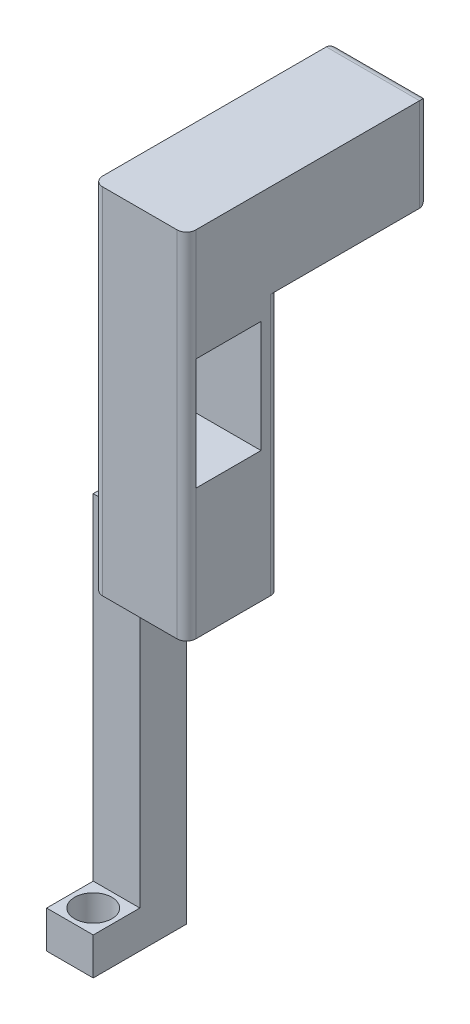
from build123d import *

# Parameters (mm, degrees)
SKETCH1_W           = 7.5
SKETCH1_H           = 5
BOSS_EXTRUDE1_DEPTH = 2
SKETCH2_W           = 5
SKETCH2_H           = 5
BOSS_EXTRUDE5_DEPTH = 17
SKETCH8_W           = 5
SKETCH8_H           = 5
BOSS_EXTRUDE6_DEPTH = 8
SKETCH9_W           = 2.5
SKETCH9_H           = 5
BOSS_EXTRUDE7_DEPTH = 18
SKETCH10_W          = 2.5
SKETCH10_H          = 18
CUT_EXTRUDE4_DEPTH  = 2.5
CUT_EXTRUDE5_DEPTH  = 2.5
FILLET2_R           = 0.5
SKETCH12_W          = 3.5
SKETCH12_H          = 6
CUT_EXTRUDE6_DEPTH  = 5


with BuildPart() as part:
    # Sketch1 → Boss-Extrude1 (new body)
    with BuildSketch(Plane(origin=(0, 0, 0), x_dir=(1, 0, 0), z_dir=(0, 1, 0))):
        Rectangle(SKETCH1_W, SKETCH1_H)
    extrude(amount=BOSS_EXTRUDE1_DEPTH)

    # Sketch2 → Boss-Extrude5 (add)
    with BuildSketch(Plane(origin=(0, 2, 0), x_dir=(1, 0, 0), z_dir=(0, 1, 0))):
        with Locations((1.25, 0)):
            Rectangle(SKETCH2_W, SKETCH2_H)
    extrude(amount=BOSS_EXTRUDE5_DEPTH)

    # Sketch8 → Boss-Extrude6 (add)
    with BuildSketch(Plane(origin=(0, 0, -2.5), x_dir=(-1, 0, 0), z_dir=(0, 0, -1))):
        with Locations((-1.25, 16.5)):
            Rectangle(SKETCH8_W, SKETCH8_H)
    extrude(amount=BOSS_EXTRUDE6_DEPTH)

    # Sketch9 → Boss-Extrude7 (add)
    with BuildSketch(Plane.XZ):
        with Locations((-2.5, 0)):
            Rectangle(SKETCH9_W, SKETCH9_H)
    extrude(amount=BOSS_EXTRUDE7_DEPTH)

    # Sketch10 → Cut-Extrude4 (cut)
    with BuildSketch(Plane.ZY.offset(3.75)):
        with Locations((1.25, -7)):
            Rectangle(SKETCH10_W, SKETCH10_H)
    extrude(amount=-CUT_EXTRUDE4_DEPTH, mode=Mode.SUBTRACT)

    # Sketch11 → Cut-Extrude5 (cut)
    with BuildSketch(Plane(origin=(0, -16, 0), x_dir=(1, 0, 0), z_dir=(0, 1, 0))):
        with BuildLine():
            ThreePointArc((-3.5, -1.25), (-2.5, -2.25), (-1.5, -1.25))
            Line((-1.5, -1.25), (-3.5, -1.25))
        make_face()
        with BuildLine():
            Line((-3.5, -1.25), (-1.5, -1.25))
            ThreePointArc((-1.5, -1.25), (-2.5, -0.25), (-3.5, -1.25))
        make_face()
        with BuildLine():
            ThreePointArc((-3.5, -1.25), (-2.5, -2.25), (-1.5, -1.25))
            Line((-1.5, -1.25), (-3.5, -1.25))
        make_face()
        with BuildLine():
            Line((-3.5, -1.25), (-1.5, -1.25))
            ThreePointArc((-1.5, -1.25), (-2.5, -0.25), (-3.5, -1.25))
        make_face()
    extrude(amount=-CUT_EXTRUDE5_DEPTH, mode=Mode.SUBTRACT)

    # Fillet2
    fillet2_edges = [part.edges().sort_by_distance(p)[0] for p in [
        (-1.25, 9.5, 2.5),
        (-1.25, 8, -2.5),
        (3.75, 7, -2.5),
        (3.75, 16.5, -10.5),
        (1.25, 14, -10.5),
        (-1.25, 16.5, -10.5),
        (1.25, 19, -10.5),
        (3.75, 9.5, 2.5),
    ]]
    fillet(fillet2_edges, radius=FILLET2_R)

    # Sketch12 → Cut-Extrude6 (cut)
    with BuildSketch(Plane.ZY.offset(1.25)):
        with Locations((0.25, 10)):
            Rectangle(SKETCH12_W, SKETCH12_H)
    extrude(amount=-CUT_EXTRUDE6_DEPTH, mode=Mode.SUBTRACT)


solid = part.part
